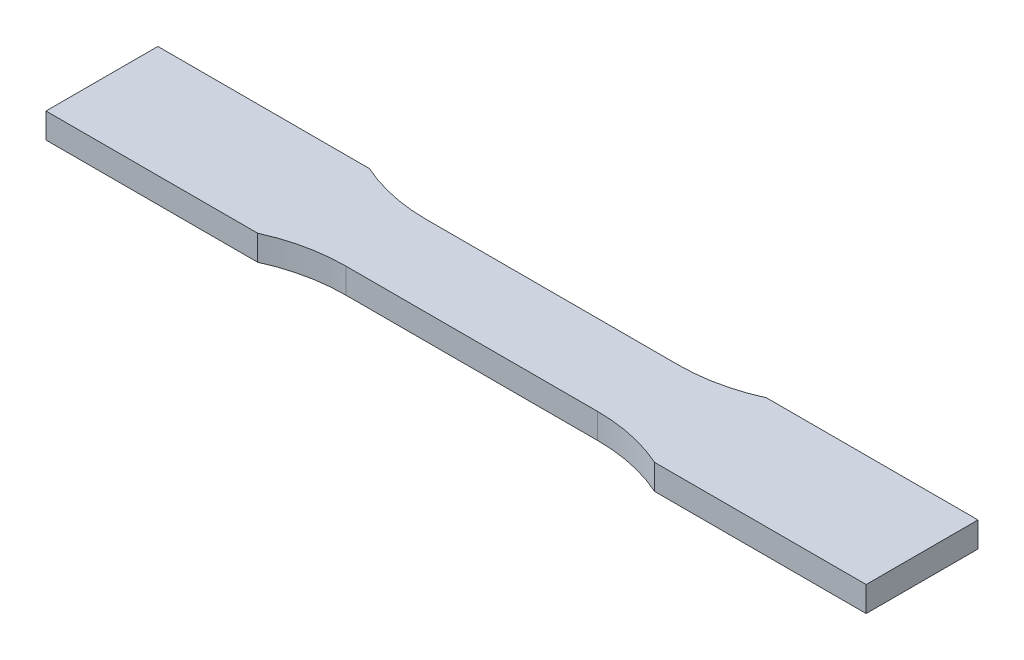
ISO-10303-21;
HEADER;
FILE_DESCRIPTION(('STEP AP214'),'2;1');
FILE_NAME('part.step','',(''),(''),'','','');
FILE_SCHEMA(('AUTOMOTIVE_DESIGN { 1 0 10303 214 1 1 1 1 }'));
ENDSEC;
DATA;
#1=APPLICATION_CONTEXT('core data for automotive mechanical design processes');
#2=APPLICATION_PROTOCOL_DEFINITION('international standard','automotive_design',2000,#1);
#3=PRODUCT_CONTEXT('',#1,'mechanical');
#4=PRODUCT('Part','Part','',(#3));
#5=PRODUCT_RELATED_PRODUCT_CATEGORY('part','',(#4));
#6=PRODUCT_DEFINITION_FORMATION('','',#4);
#7=PRODUCT_DEFINITION_CONTEXT('part definition',#1,'design');
#8=PRODUCT_DEFINITION('design','',#6,#7);
#9=PRODUCT_DEFINITION_SHAPE('','',#8);
#10=(LENGTH_UNIT() NAMED_UNIT(*) SI_UNIT(.MILLI.,.METRE.));
#11=(NAMED_UNIT(*) PLANE_ANGLE_UNIT() SI_UNIT($,.RADIAN.));
#12=(NAMED_UNIT(*) SI_UNIT($,.STERADIAN.) SOLID_ANGLE_UNIT());
#13=UNCERTAINTY_MEASURE_WITH_UNIT(LENGTH_MEASURE(1.E-05),#10,'distance_accuracy_value','');
#14=(GEOMETRIC_REPRESENTATION_CONTEXT(3) GLOBAL_UNCERTAINTY_ASSIGNED_CONTEXT((#13)) GLOBAL_UNIT_ASSIGNED_CONTEXT((#10,
#11,#12)) REPRESENTATION_CONTEXT('',''));
#15=CARTESIAN_POINT('',(0.,0.,0.));
#16=DIRECTION('',(0.,0.,1.));
#17=DIRECTION('',(1.,0.,0.));
#18=AXIS2_PLACEMENT_3D('',#15,#16,#17);
#19=CARTESIAN_POINT('',(-25.,-2.5,-43.));
#20=DIRECTION('',(0.,1.,0.));
#21=DIRECTION('',(0.,0.,1.));
#22=AXIS2_PLACEMENT_3D('',#19,#20,#21);
#23=CYLINDRICAL_SURFACE('',#22,35.);
#24=DIRECTION('',(0.,1.,0.));
#25=VECTOR('',#24,1.);
#26=CARTESIAN_POINT('',(-39.4010416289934,-2.5,-11.1));
#27=LINE('',#26,#25);
#28=CARTESIAN_POINT('',(-39.4010416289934,-2.5,-11.1));
#29=VERTEX_POINT('',#28);
#30=CARTESIAN_POINT('',(-39.4010416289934,2.5,-11.1));
#31=VERTEX_POINT('',#30);
#32=EDGE_CURVE('E36',#29,#31,#27,.T.);
#33=ORIENTED_EDGE('',*,*,#32,.T.);
#34=CARTESIAN_POINT('',(-25.,2.5,-43.));
#35=DIRECTION('',(0.,-1.,0.));
#36=DIRECTION('',(0.,0.,-1.));
#37=AXIS2_PLACEMENT_3D('',#34,#35,#36);
#38=CIRCLE('',#37,35.);
#39=CARTESIAN_POINT('',(-25.,2.5,-8.));
#40=VERTEX_POINT('',#39);
#41=EDGE_CURVE('E121',#40,#31,#38,.T.);
#42=ORIENTED_EDGE('',*,*,#41,.F.);
#43=DIRECTION('',(0.,1.,0.));
#44=VECTOR('',#43,1.);
#45=CARTESIAN_POINT('',(-25.,-2.5,-8.));
#46=LINE('',#45,#44);
#47=CARTESIAN_POINT('',(-25.,-2.5,-8.));
#48=VERTEX_POINT('',#47);
#49=EDGE_CURVE('E11',#48,#40,#46,.T.);
#50=ORIENTED_EDGE('',*,*,#49,.F.);
#51=CARTESIAN_POINT('',(-25.,-2.5,-43.));
#52=DIRECTION('',(0.,-1.,0.));
#53=DIRECTION('',(0.,0.,-1.));
#54=AXIS2_PLACEMENT_3D('',#51,#52,#53);
#55=CIRCLE('',#54,35.);
#56=EDGE_CURVE('E122',#48,#29,#55,.T.);
#57=ORIENTED_EDGE('',*,*,#56,.T.);
#58=EDGE_LOOP('',(#33,#42,#50,#57));
#59=FACE_BOUND('',#58,.T.);
#60=ADVANCED_FACE('F33',(#59),#23,.F.);
#61=CARTESIAN_POINT('',(-25.,-2.5,-8.));
#62=DIRECTION('',(0.,0.,-1.));
#63=DIRECTION('',(-1.,0.,0.));
#64=AXIS2_PLACEMENT_3D('',#61,#62,#63);
#65=PLANE('',#64);
#66=ORIENTED_EDGE('',*,*,#49,.T.);
#67=DIRECTION('',(-1.,0.,0.));
#68=VECTOR('',#67,1.);
#69=CARTESIAN_POINT('',(-25.,2.5,-8.));
#70=LINE('',#69,#68);
#71=CARTESIAN_POINT('',(25.,2.5,-8.00000000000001));
#72=VERTEX_POINT('',#71);
#73=EDGE_CURVE('E139',#72,#40,#70,.T.);
#74=ORIENTED_EDGE('',*,*,#73,.F.);
#75=DIRECTION('',(0.,1.,0.));
#76=VECTOR('',#75,1.);
#77=CARTESIAN_POINT('',(25.,-2.5,-8.00000000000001));
#78=LINE('',#77,#76);
#79=CARTESIAN_POINT('',(25.,-2.5,-8.00000000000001));
#80=VERTEX_POINT('',#79);
#81=EDGE_CURVE('E41',#80,#72,#78,.T.);
#82=ORIENTED_EDGE('',*,*,#81,.F.);
#83=DIRECTION('',(-1.,0.,0.));
#84=VECTOR('',#83,1.);
#85=CARTESIAN_POINT('',(-25.,-2.5,-8.));
#86=LINE('',#85,#84);
#87=EDGE_CURVE('E127',#80,#48,#86,.T.);
#88=ORIENTED_EDGE('',*,*,#87,.T.);
#89=EDGE_LOOP('',(#66,#74,#82,#88));
#90=FACE_BOUND('',#89,.T.);
#91=ADVANCED_FACE('F251',(#90),#65,.T.);
#92=CARTESIAN_POINT('',(25.,-2.5,-43.));
#93=DIRECTION('',(0.,1.,0.));
#94=DIRECTION('',(0.,0.,1.));
#95=AXIS2_PLACEMENT_3D('',#92,#93,#94);
#96=CYLINDRICAL_SURFACE('',#95,35.);
#97=ORIENTED_EDGE('',*,*,#81,.T.);
#98=CARTESIAN_POINT('',(25.,2.5,-43.));
#99=DIRECTION('',(0.,-1.,0.));
#100=DIRECTION('',(0.,0.,1.));
#101=AXIS2_PLACEMENT_3D('',#98,#99,#100);
#102=CIRCLE('',#101,35.);
#103=CARTESIAN_POINT('',(39.4010416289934,2.5,-11.1));
#104=VERTEX_POINT('',#103);
#105=EDGE_CURVE('E164',#104,#72,#102,.T.);
#106=ORIENTED_EDGE('',*,*,#105,.F.);
#107=DIRECTION('',(0.,1.,0.));
#108=VECTOR('',#107,1.);
#109=CARTESIAN_POINT('',(39.4010416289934,-2.5,-11.1));
#110=LINE('',#109,#108);
#111=CARTESIAN_POINT('',(39.4010416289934,-2.5,-11.1));
#112=VERTEX_POINT('',#111);
#113=EDGE_CURVE('E198',#112,#104,#110,.T.);
#114=ORIENTED_EDGE('',*,*,#113,.F.);
#115=CARTESIAN_POINT('',(25.,-2.5,-43.));
#116=DIRECTION('',(0.,-1.,0.));
#117=DIRECTION('',(0.,0.,1.));
#118=AXIS2_PLACEMENT_3D('',#115,#116,#117);
#119=CIRCLE('',#118,35.);
#120=EDGE_CURVE('E194',#112,#80,#119,.T.);
#121=ORIENTED_EDGE('',*,*,#120,.T.);
#122=EDGE_LOOP('',(#97,#106,#114,#121));
#123=FACE_BOUND('',#122,.T.);
#124=ADVANCED_FACE('F249',(#123),#96,.F.);
#125=CARTESIAN_POINT('',(39.4010416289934,-2.5,-11.1));
#126=DIRECTION('',(0.,0.,-1.));
#127=DIRECTION('',(-1.,0.,0.));
#128=AXIS2_PLACEMENT_3D('',#125,#126,#127);
#129=PLANE('',#128);
#130=ORIENTED_EDGE('',*,*,#113,.T.);
#131=DIRECTION('',(-1.,0.,0.));
#132=VECTOR('',#131,1.);
#133=CARTESIAN_POINT('',(39.4010416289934,2.5,-11.1));
#134=LINE('',#133,#132);
#135=CARTESIAN_POINT('',(81.4010416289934,2.5,-11.1));
#136=VERTEX_POINT('',#135);
#137=EDGE_CURVE('E161',#136,#104,#134,.T.);
#138=ORIENTED_EDGE('',*,*,#137,.F.);
#139=DIRECTION('',(0.,1.,0.));
#140=VECTOR('',#139,1.);
#141=CARTESIAN_POINT('',(81.4010416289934,-2.5,-11.1));
#142=LINE('',#141,#140);
#143=CARTESIAN_POINT('',(81.4010416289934,-2.5,-11.1));
#144=VERTEX_POINT('',#143);
#145=EDGE_CURVE('E200',#144,#136,#142,.T.);
#146=ORIENTED_EDGE('',*,*,#145,.F.);
#147=DIRECTION('',(-1.,0.,0.));
#148=VECTOR('',#147,1.);
#149=CARTESIAN_POINT('',(39.4010416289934,-2.5,-11.1));
#150=LINE('',#149,#148);
#151=EDGE_CURVE('E191',#144,#112,#150,.T.);
#152=ORIENTED_EDGE('',*,*,#151,.T.);
#153=EDGE_LOOP('',(#130,#138,#146,#152));
#154=FACE_BOUND('',#153,.T.);
#155=ADVANCED_FACE('F247',(#154),#129,.T.);
#156=CARTESIAN_POINT('',(81.4010416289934,-2.5,-11.1));
#157=DIRECTION('',(1.,0.,0.));
#158=DIRECTION('',(0.,0.,-1.));
#159=AXIS2_PLACEMENT_3D('',#156,#157,#158);
#160=PLANE('',#159);
#161=ORIENTED_EDGE('',*,*,#145,.T.);
#162=DIRECTION('',(0.,0.,-1.));
#163=VECTOR('',#162,1.);
#164=CARTESIAN_POINT('',(81.4010416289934,2.5,-11.1));
#165=LINE('',#164,#163);
#166=CARTESIAN_POINT('',(81.4010416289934,2.5,11.1));
#167=VERTEX_POINT('',#166);
#168=EDGE_CURVE('E158',#167,#136,#165,.T.);
#169=ORIENTED_EDGE('',*,*,#168,.F.);
#170=DIRECTION('',(0.,1.,0.));
#171=VECTOR('',#170,1.);
#172=CARTESIAN_POINT('',(81.4010416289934,-2.5,11.1));
#173=LINE('',#172,#171);
#174=CARTESIAN_POINT('',(81.4010416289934,-2.5,11.1));
#175=VERTEX_POINT('',#174);
#176=EDGE_CURVE('E202',#175,#167,#173,.T.);
#177=ORIENTED_EDGE('',*,*,#176,.F.);
#178=DIRECTION('',(0.,0.,-1.));
#179=VECTOR('',#178,1.);
#180=CARTESIAN_POINT('',(81.4010416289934,-2.5,-11.1));
#181=LINE('',#180,#179);
#182=EDGE_CURVE('E188',#175,#144,#181,.T.);
#183=ORIENTED_EDGE('',*,*,#182,.T.);
#184=EDGE_LOOP('',(#161,#169,#177,#183));
#185=FACE_BOUND('',#184,.T.);
#186=ADVANCED_FACE('F242',(#185),#160,.T.);
#187=CARTESIAN_POINT('',(39.4010416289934,-2.5,11.1));
#188=DIRECTION('',(0.,0.,1.));
#189=DIRECTION('',(1.,0.,0.));
#190=AXIS2_PLACEMENT_3D('',#187,#188,#189);
#191=PLANE('',#190);
#192=ORIENTED_EDGE('',*,*,#176,.T.);
#193=DIRECTION('',(1.,0.,0.));
#194=VECTOR('',#193,1.);
#195=CARTESIAN_POINT('',(39.4010416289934,2.5,11.1));
#196=LINE('',#195,#194);
#197=CARTESIAN_POINT('',(39.4010416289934,2.5,11.1));
#198=VERTEX_POINT('',#197);
#199=EDGE_CURVE('E155',#198,#167,#196,.T.);
#200=ORIENTED_EDGE('',*,*,#199,.F.);
#201=DIRECTION('',(0.,1.,0.));
#202=VECTOR('',#201,1.);
#203=CARTESIAN_POINT('',(39.4010416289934,-2.5,11.1));
#204=LINE('',#203,#202);
#205=CARTESIAN_POINT('',(39.4010416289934,-2.5,11.1));
#206=VERTEX_POINT('',#205);
#207=EDGE_CURVE('E204',#206,#198,#204,.T.);
#208=ORIENTED_EDGE('',*,*,#207,.F.);
#209=DIRECTION('',(1.,0.,0.));
#210=VECTOR('',#209,1.);
#211=CARTESIAN_POINT('',(39.4010416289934,-2.5,11.1));
#212=LINE('',#211,#210);
#213=EDGE_CURVE('E185',#206,#175,#212,.T.);
#214=ORIENTED_EDGE('',*,*,#213,.T.);
#215=EDGE_LOOP('',(#192,#200,#208,#214));
#216=FACE_BOUND('',#215,.T.);
#217=ADVANCED_FACE('F237',(#216),#191,.T.);
#218=CARTESIAN_POINT('',(25.,-2.5,43.));
#219=DIRECTION('',(0.,1.,0.));
#220=DIRECTION('',(0.,0.,1.));
#221=AXIS2_PLACEMENT_3D('',#218,#219,#220);
#222=CYLINDRICAL_SURFACE('',#221,35.);
#223=ORIENTED_EDGE('',*,*,#207,.T.);
#224=CARTESIAN_POINT('',(25.,2.5,43.));
#225=DIRECTION('',(0.,-1.,0.));
#226=DIRECTION('',(0.,0.,-1.));
#227=AXIS2_PLACEMENT_3D('',#224,#225,#226);
#228=CIRCLE('',#227,35.);
#229=CARTESIAN_POINT('',(25.,2.5,8.00000000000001));
#230=VERTEX_POINT('',#229);
#231=EDGE_CURVE('E152',#230,#198,#228,.T.);
#232=ORIENTED_EDGE('',*,*,#231,.F.);
#233=DIRECTION('',(0.,1.,0.));
#234=VECTOR('',#233,1.);
#235=CARTESIAN_POINT('',(25.,-2.5,8.00000000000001));
#236=LINE('',#235,#234);
#237=CARTESIAN_POINT('',(25.,-2.5,8.00000000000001));
#238=VERTEX_POINT('',#237);
#239=EDGE_CURVE('E206',#238,#230,#236,.T.);
#240=ORIENTED_EDGE('',*,*,#239,.F.);
#241=CARTESIAN_POINT('',(25.,-2.5,43.));
#242=DIRECTION('',(0.,-1.,0.));
#243=DIRECTION('',(0.,0.,-1.));
#244=AXIS2_PLACEMENT_3D('',#241,#242,#243);
#245=CIRCLE('',#244,35.);
#246=EDGE_CURVE('E182',#238,#206,#245,.T.);
#247=ORIENTED_EDGE('',*,*,#246,.T.);
#248=EDGE_LOOP('',(#223,#232,#240,#247));
#249=FACE_BOUND('',#248,.T.);
#250=ADVANCED_FACE('F235',(#249),#222,.F.);
#251=CARTESIAN_POINT('',(-25.,-2.5,8.));
#252=DIRECTION('',(0.,0.,1.));
#253=DIRECTION('',(1.,0.,0.));
#254=AXIS2_PLACEMENT_3D('',#251,#252,#253);
#255=PLANE('',#254);
#256=ORIENTED_EDGE('',*,*,#239,.T.);
#257=DIRECTION('',(1.,0.,0.));
#258=VECTOR('',#257,1.);
#259=CARTESIAN_POINT('',(-25.,2.5,8.));
#260=LINE('',#259,#258);
#261=CARTESIAN_POINT('',(-25.,2.5,8.));
#262=VERTEX_POINT('',#261);
#263=EDGE_CURVE('E149',#262,#230,#260,.T.);
#264=ORIENTED_EDGE('',*,*,#263,.F.);
#265=DIRECTION('',(0.,1.,0.));
#266=VECTOR('',#265,1.);
#267=CARTESIAN_POINT('',(-25.,-2.5,8.));
#268=LINE('',#267,#266);
#269=CARTESIAN_POINT('',(-25.,-2.5,8.));
#270=VERTEX_POINT('',#269);
#271=EDGE_CURVE('E208',#270,#262,#268,.T.);
#272=ORIENTED_EDGE('',*,*,#271,.F.);
#273=DIRECTION('',(1.,0.,0.));
#274=VECTOR('',#273,1.);
#275=CARTESIAN_POINT('',(-25.,-2.5,8.));
#276=LINE('',#275,#274);
#277=EDGE_CURVE('E179',#270,#238,#276,.T.);
#278=ORIENTED_EDGE('',*,*,#277,.T.);
#279=EDGE_LOOP('',(#256,#264,#272,#278));
#280=FACE_BOUND('',#279,.T.);
#281=ADVANCED_FACE('F230',(#280),#255,.T.);
#282=CARTESIAN_POINT('',(-25.,-2.5,43.));
#283=DIRECTION('',(0.,1.,0.));
#284=DIRECTION('',(0.,0.,1.));
#285=AXIS2_PLACEMENT_3D('',#282,#283,#284);
#286=CYLINDRICAL_SURFACE('',#285,35.);
#287=ORIENTED_EDGE('',*,*,#271,.T.);
#288=CARTESIAN_POINT('',(-25.,2.5,43.));
#289=DIRECTION('',(0.,-1.,0.));
#290=DIRECTION('',(0.,0.,1.));
#291=AXIS2_PLACEMENT_3D('',#288,#289,#290);
#292=CIRCLE('',#291,35.);
#293=CARTESIAN_POINT('',(-39.4010416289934,2.5,11.1));
#294=VERTEX_POINT('',#293);
#295=EDGE_CURVE('E146',#294,#262,#292,.T.);
#296=ORIENTED_EDGE('',*,*,#295,.F.);
#297=DIRECTION('',(0.,1.,0.));
#298=VECTOR('',#297,1.);
#299=CARTESIAN_POINT('',(-39.4010416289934,-2.5,11.1));
#300=LINE('',#299,#298);
#301=CARTESIAN_POINT('',(-39.4010416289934,-2.5,11.1));
#302=VERTEX_POINT('',#301);
#303=EDGE_CURVE('E210',#302,#294,#300,.T.);
#304=ORIENTED_EDGE('',*,*,#303,.F.);
#305=CARTESIAN_POINT('',(-25.,-2.5,43.));
#306=DIRECTION('',(0.,-1.,0.));
#307=DIRECTION('',(0.,0.,1.));
#308=AXIS2_PLACEMENT_3D('',#305,#306,#307);
#309=CIRCLE('',#308,35.);
#310=EDGE_CURVE('E176',#302,#270,#309,.T.);
#311=ORIENTED_EDGE('',*,*,#310,.T.);
#312=EDGE_LOOP('',(#287,#296,#304,#311));
#313=FACE_BOUND('',#312,.T.);
#314=ADVANCED_FACE('F223',(#313),#286,.F.);
#315=CARTESIAN_POINT('',(-39.4010416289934,-2.5,11.1));
#316=DIRECTION('',(0.,0.,1.));
#317=DIRECTION('',(1.,0.,0.));
#318=AXIS2_PLACEMENT_3D('',#315,#316,#317);
#319=PLANE('',#318);
#320=ORIENTED_EDGE('',*,*,#303,.T.);
#321=DIRECTION('',(1.,0.,0.));
#322=VECTOR('',#321,1.);
#323=CARTESIAN_POINT('',(-39.4010416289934,2.5,11.1));
#324=LINE('',#323,#322);
#325=CARTESIAN_POINT('',(-81.4010416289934,2.5,11.1));
#326=VERTEX_POINT('',#325);
#327=EDGE_CURVE('E143',#326,#294,#324,.T.);
#328=ORIENTED_EDGE('',*,*,#327,.F.);
#329=DIRECTION('',(0.,1.,0.));
#330=VECTOR('',#329,1.);
#331=CARTESIAN_POINT('',(-81.4010416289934,-2.5,11.1));
#332=LINE('',#331,#330);
#333=CARTESIAN_POINT('',(-81.4010416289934,-2.5,11.1));
#334=VERTEX_POINT('',#333);
#335=EDGE_CURVE('E212',#334,#326,#332,.T.);
#336=ORIENTED_EDGE('',*,*,#335,.F.);
#337=DIRECTION('',(1.,0.,0.));
#338=VECTOR('',#337,1.);
#339=CARTESIAN_POINT('',(-39.4010416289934,-2.5,11.1));
#340=LINE('',#339,#338);
#341=EDGE_CURVE('E173',#334,#302,#340,.T.);
#342=ORIENTED_EDGE('',*,*,#341,.T.);
#343=EDGE_LOOP('',(#320,#328,#336,#342));
#344=FACE_BOUND('',#343,.T.);
#345=ADVANCED_FACE('F220',(#344),#319,.T.);
#346=CARTESIAN_POINT('',(-81.4010416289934,-2.5,-11.1));
#347=DIRECTION('',(-1.,0.,0.));
#348=DIRECTION('',(0.,0.,1.));
#349=AXIS2_PLACEMENT_3D('',#346,#347,#348);
#350=PLANE('',#349);
#351=ORIENTED_EDGE('',*,*,#335,.T.);
#352=DIRECTION('',(0.,0.,1.));
#353=VECTOR('',#352,1.);
#354=CARTESIAN_POINT('',(-81.4010416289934,2.5,-11.1));
#355=LINE('',#354,#353);
#356=CARTESIAN_POINT('',(-81.4010416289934,2.5,-11.1));
#357=VERTEX_POINT('',#356);
#358=EDGE_CURVE('E134',#357,#326,#355,.T.);
#359=ORIENTED_EDGE('',*,*,#358,.F.);
#360=DIRECTION('',(0.,1.,0.));
#361=VECTOR('',#360,1.);
#362=CARTESIAN_POINT('',(-81.4010416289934,-2.5,-11.1));
#363=LINE('',#362,#361);
#364=CARTESIAN_POINT('',(-81.4010416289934,-2.5,-11.1));
#365=VERTEX_POINT('',#364);
#366=EDGE_CURVE('E126',#365,#357,#363,.T.);
#367=ORIENTED_EDGE('',*,*,#366,.F.);
#368=DIRECTION('',(0.,0.,1.));
#369=VECTOR('',#368,1.);
#370=CARTESIAN_POINT('',(-81.4010416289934,-2.5,-11.1));
#371=LINE('',#370,#369);
#372=EDGE_CURVE('E170',#365,#334,#371,.T.);
#373=ORIENTED_EDGE('',*,*,#372,.T.);
#374=EDGE_LOOP('',(#351,#359,#367,#373));
#375=FACE_BOUND('',#374,.T.);
#376=ADVANCED_FACE('F214',(#375),#350,.T.);
#377=CARTESIAN_POINT('',(-39.4010416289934,-2.5,-11.1));
#378=DIRECTION('',(0.,0.,-1.));
#379=DIRECTION('',(-1.,0.,0.));
#380=AXIS2_PLACEMENT_3D('',#377,#378,#379);
#381=PLANE('',#380);
#382=ORIENTED_EDGE('',*,*,#366,.T.);
#383=DIRECTION('',(-1.,0.,0.));
#384=VECTOR('',#383,1.);
#385=CARTESIAN_POINT('',(-39.4010416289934,2.5,-11.1));
#386=LINE('',#385,#384);
#387=EDGE_CURVE('E129',#31,#357,#386,.T.);
#388=ORIENTED_EDGE('',*,*,#387,.F.);
#389=ORIENTED_EDGE('',*,*,#32,.F.);
#390=DIRECTION('',(-1.,0.,0.));
#391=VECTOR('',#390,1.);
#392=CARTESIAN_POINT('',(-39.4010416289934,-2.5,-11.1));
#393=LINE('',#392,#391);
#394=EDGE_CURVE('E168',#29,#365,#393,.T.);
#395=ORIENTED_EDGE('',*,*,#394,.T.);
#396=EDGE_LOOP('',(#382,#388,#389,#395));
#397=FACE_BOUND('',#396,.T.);
#398=ADVANCED_FACE('F130',(#397),#381,.T.);
#399=CARTESIAN_POINT('',(-25.,-2.5,-43.));
#400=DIRECTION('',(0.,-1.,0.));
#401=DIRECTION('',(0.,0.,-1.));
#402=AXIS2_PLACEMENT_3D('',#399,#400,#401);
#403=PLANE('',#402);
#404=ORIENTED_EDGE('',*,*,#56,.F.);
#405=ORIENTED_EDGE('',*,*,#87,.F.);
#406=ORIENTED_EDGE('',*,*,#120,.F.);
#407=ORIENTED_EDGE('',*,*,#151,.F.);
#408=ORIENTED_EDGE('',*,*,#182,.F.);
#409=ORIENTED_EDGE('',*,*,#213,.F.);
#410=ORIENTED_EDGE('',*,*,#246,.F.);
#411=ORIENTED_EDGE('',*,*,#277,.F.);
#412=ORIENTED_EDGE('',*,*,#310,.F.);
#413=ORIENTED_EDGE('',*,*,#341,.F.);
#414=ORIENTED_EDGE('',*,*,#372,.F.);
#415=ORIENTED_EDGE('',*,*,#394,.F.);
#416=EDGE_LOOP('',(#404,#405,#406,#407,#408,#409,#410,#411,#412,#413,#414,#415));
#417=FACE_BOUND('',#416,.T.);
#418=ADVANCED_FACE('F226',(#417),#403,.T.);
#419=CARTESIAN_POINT('',(-25.,2.5,-43.));
#420=DIRECTION('',(0.,-1.,0.));
#421=DIRECTION('',(0.,0.,-1.));
#422=AXIS2_PLACEMENT_3D('',#419,#420,#421);
#423=PLANE('',#422);
#424=ORIENTED_EDGE('',*,*,#41,.T.);
#425=ORIENTED_EDGE('',*,*,#387,.T.);
#426=ORIENTED_EDGE('',*,*,#358,.T.);
#427=ORIENTED_EDGE('',*,*,#327,.T.);
#428=ORIENTED_EDGE('',*,*,#295,.T.);
#429=ORIENTED_EDGE('',*,*,#263,.T.);
#430=ORIENTED_EDGE('',*,*,#231,.T.);
#431=ORIENTED_EDGE('',*,*,#199,.T.);
#432=ORIENTED_EDGE('',*,*,#168,.T.);
#433=ORIENTED_EDGE('',*,*,#137,.T.);
#434=ORIENTED_EDGE('',*,*,#105,.T.);
#435=ORIENTED_EDGE('',*,*,#73,.T.);
#436=EDGE_LOOP('',(#424,#425,#426,#427,#428,#429,#430,#431,#432,#433,#434,#435));
#437=FACE_BOUND('',#436,.T.);
#438=ADVANCED_FACE('F137',(#437),#423,.F.);
#439=CLOSED_SHELL('',(#60,#91,#124,#155,#186,#217,#250,#281,#314,#345,#376,#398,#418,#438));
#440=MANIFOLD_SOLID_BREP('B2',#439);
#441=ADVANCED_BREP_SHAPE_REPRESENTATION('',(#18,#440),#14);
#442=SHAPE_DEFINITION_REPRESENTATION(#9,#441);
ENDSEC;
END-ISO-10303-21;
